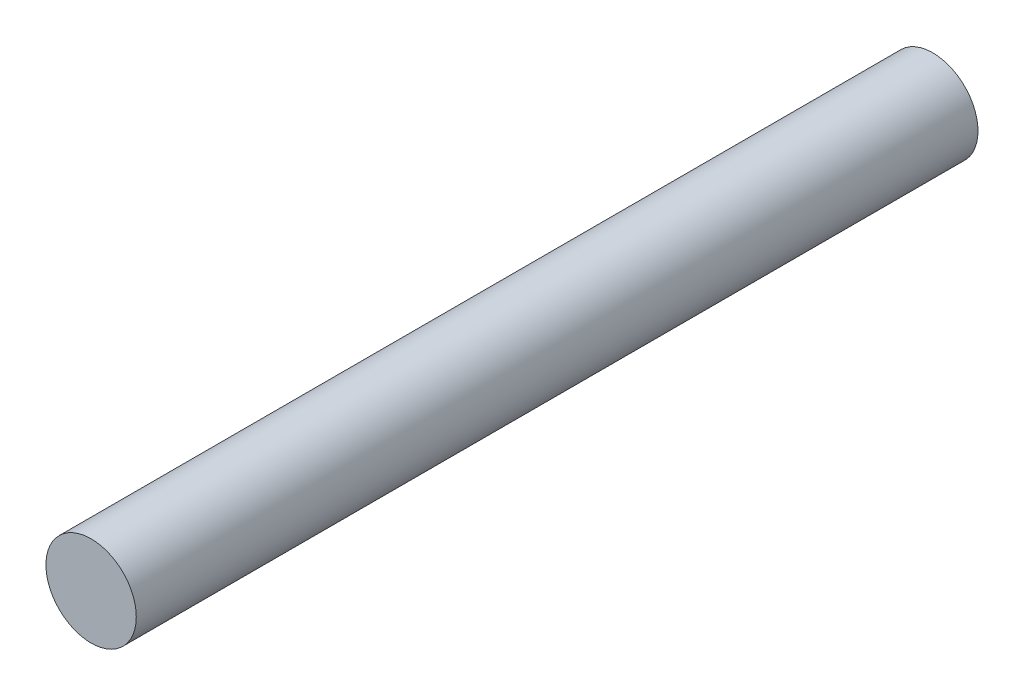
ISO-10303-21;
HEADER;
FILE_DESCRIPTION(('STEP AP214'),'2;1');
FILE_NAME('part.step','',(''),(''),'','','');
FILE_SCHEMA(('AUTOMOTIVE_DESIGN { 1 0 10303 214 1 1 1 1 }'));
ENDSEC;
DATA;
#1=APPLICATION_CONTEXT('core data for automotive mechanical design processes');
#2=APPLICATION_PROTOCOL_DEFINITION('international standard','automotive_design',2000,#1);
#3=PRODUCT_CONTEXT('',#1,'mechanical');
#4=PRODUCT('Part','Part','',(#3));
#5=PRODUCT_RELATED_PRODUCT_CATEGORY('part','',(#4));
#6=PRODUCT_DEFINITION_FORMATION('','',#4);
#7=PRODUCT_DEFINITION_CONTEXT('part definition',#1,'design');
#8=PRODUCT_DEFINITION('design','',#6,#7);
#9=PRODUCT_DEFINITION_SHAPE('','',#8);
#10=(LENGTH_UNIT() NAMED_UNIT(*) SI_UNIT(.MILLI.,.METRE.));
#11=(NAMED_UNIT(*) PLANE_ANGLE_UNIT() SI_UNIT($,.RADIAN.));
#12=(NAMED_UNIT(*) SI_UNIT($,.STERADIAN.) SOLID_ANGLE_UNIT());
#13=UNCERTAINTY_MEASURE_WITH_UNIT(LENGTH_MEASURE(1.E-05),#10,'distance_accuracy_value','');
#14=(GEOMETRIC_REPRESENTATION_CONTEXT(3) GLOBAL_UNCERTAINTY_ASSIGNED_CONTEXT((#13)) GLOBAL_UNIT_ASSIGNED_CONTEXT((#10,
#11,#12)) REPRESENTATION_CONTEXT('',''));
#15=CARTESIAN_POINT('',(0.,0.,0.));
#16=DIRECTION('',(0.,0.,1.));
#17=DIRECTION('',(1.,0.,0.));
#18=AXIS2_PLACEMENT_3D('',#15,#16,#17);
#19=CARTESIAN_POINT('',(0.,0.,12.065));
#20=DIRECTION('',(0.,0.,-1.));
#21=DIRECTION('',(-1.,0.,0.));
#22=AXIS2_PLACEMENT_3D('',#19,#20,#21);
#23=CYLINDRICAL_SURFACE('',#22,0.6477);
#24=CARTESIAN_POINT('',(0.,0.,12.065));
#25=DIRECTION('',(0.,0.,1.));
#26=DIRECTION('',(1.,0.,0.));
#27=AXIS2_PLACEMENT_3D('',#24,#25,#26);
#28=CIRCLE('',#27,0.6477);
#29=CARTESIAN_POINT('',(0.6477,0.,12.065));
#30=VERTEX_POINT('',#29);
#31=EDGE_CURVE('E10',#30,#30,#28,.T.);
#32=ORIENTED_EDGE('',*,*,#31,.F.);
#33=EDGE_LOOP('',(#32));
#34=FACE_BOUND('',#33,.T.);
#35=CARTESIAN_POINT('',(0.,0.,0.));
#36=DIRECTION('',(0.,0.,1.));
#37=DIRECTION('',(1.,0.,0.));
#38=AXIS2_PLACEMENT_3D('',#35,#36,#37);
#39=CIRCLE('',#38,0.6477);
#40=CARTESIAN_POINT('',(0.6477,0.,0.));
#41=VERTEX_POINT('',#40);
#42=EDGE_CURVE('E33',#41,#41,#39,.T.);
#43=ORIENTED_EDGE('',*,*,#42,.T.);
#44=EDGE_LOOP('',(#43));
#45=FACE_BOUND('',#44,.T.);
#46=ADVANCED_FACE('F30',(#34,#45),#23,.T.);
#47=CARTESIAN_POINT('',(0.,0.,12.065));
#48=DIRECTION('',(0.,0.,1.));
#49=DIRECTION('',(1.,0.,0.));
#50=AXIS2_PLACEMENT_3D('',#47,#48,#49);
#51=PLANE('',#50);
#52=ORIENTED_EDGE('',*,*,#31,.T.);
#53=EDGE_LOOP('',(#52));
#54=FACE_BOUND('',#53,.T.);
#55=ADVANCED_FACE('F45',(#54),#51,.T.);
#56=CARTESIAN_POINT('',(0.,0.,0.));
#57=DIRECTION('',(0.,0.,1.));
#58=DIRECTION('',(1.,0.,0.));
#59=AXIS2_PLACEMENT_3D('',#56,#57,#58);
#60=PLANE('',#59);
#61=ORIENTED_EDGE('',*,*,#42,.F.);
#62=EDGE_LOOP('',(#61));
#63=FACE_BOUND('',#62,.T.);
#64=ADVANCED_FACE('F43',(#63),#60,.F.);
#65=CLOSED_SHELL('',(#46,#55,#64));
#66=MANIFOLD_SOLID_BREP('B2',#65);
#67=ADVANCED_BREP_SHAPE_REPRESENTATION('',(#18,#66),#14);
#68=SHAPE_DEFINITION_REPRESENTATION(#9,#67);
ENDSEC;
END-ISO-10303-21;
